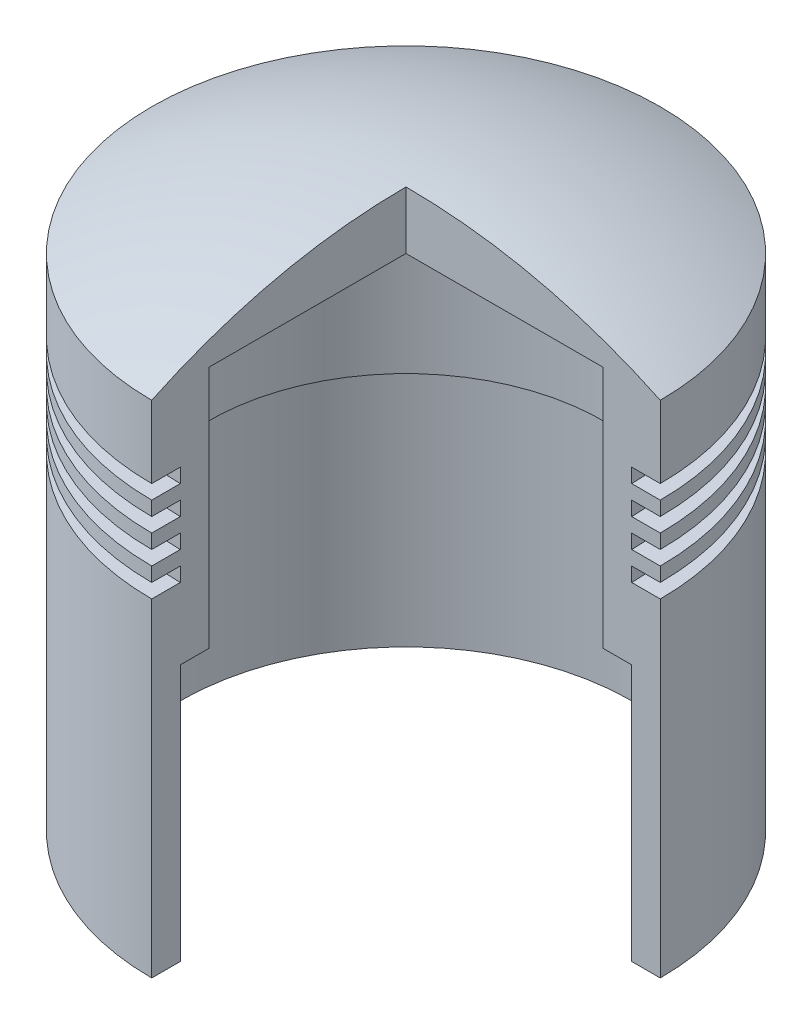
ISO-10303-21;
HEADER;
FILE_DESCRIPTION(('STEP AP214'),'2;1');
FILE_NAME('part.step','',(''),(''),'','','');
FILE_SCHEMA(('AUTOMOTIVE_DESIGN { 1 0 10303 214 1 1 1 1 }'));
ENDSEC;
DATA;
#1=APPLICATION_CONTEXT('core data for automotive mechanical design processes');
#2=APPLICATION_PROTOCOL_DEFINITION('international standard','automotive_design',2000,#1);
#3=PRODUCT_CONTEXT('',#1,'mechanical');
#4=PRODUCT('Part','Part','',(#3));
#5=PRODUCT_RELATED_PRODUCT_CATEGORY('part','',(#4));
#6=PRODUCT_DEFINITION_FORMATION('','',#4);
#7=PRODUCT_DEFINITION_CONTEXT('part definition',#1,'design');
#8=PRODUCT_DEFINITION('design','',#6,#7);
#9=PRODUCT_DEFINITION_SHAPE('','',#8);
#10=(LENGTH_UNIT() NAMED_UNIT(*) SI_UNIT(.MILLI.,.METRE.));
#11=(NAMED_UNIT(*) PLANE_ANGLE_UNIT() SI_UNIT($,.RADIAN.));
#12=(NAMED_UNIT(*) SI_UNIT($,.STERADIAN.) SOLID_ANGLE_UNIT());
#13=UNCERTAINTY_MEASURE_WITH_UNIT(LENGTH_MEASURE(1.E-05),#10,'distance_accuracy_value','');
#14=(GEOMETRIC_REPRESENTATION_CONTEXT(3) GLOBAL_UNCERTAINTY_ASSIGNED_CONTEXT((#13)) GLOBAL_UNIT_ASSIGNED_CONTEXT((#10,
#11,#12)) REPRESENTATION_CONTEXT('',''));
#15=CARTESIAN_POINT('',(0.,0.,0.));
#16=DIRECTION('',(0.,0.,1.));
#17=DIRECTION('',(1.,0.,0.));
#18=AXIS2_PLACEMENT_3D('',#15,#16,#17);
#19=CARTESIAN_POINT('',(4.27667832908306E-13,72.2640545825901,44.5392513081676));
#20=DIRECTION('',(0.,-1.,0.));
#21=DIRECTION('',(1.,0.,0.));
#22=AXIS2_PLACEMENT_3D('',#19,#20,#21);
#23=PLANE('',#22);
#24=CARTESIAN_POINT('',(0.,72.2640545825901,0.));
#25=DIRECTION('',(0.,-1.,0.));
#26=DIRECTION('',(1.,0.,0.));
#27=AXIS2_PLACEMENT_3D('',#24,#25,#26);
#28=CIRCLE('',#27,44.5392513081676);
#29=CARTESIAN_POINT('',(4.27667832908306E-13,72.2640545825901,44.5392513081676));
#30=VERTEX_POINT('',#29);
#31=CARTESIAN_POINT('',(44.5392513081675,72.2640545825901,0.));
#32=VERTEX_POINT('',#31);
#33=EDGE_CURVE('E11',#30,#32,#28,.T.);
#34=ORIENTED_EDGE('',*,*,#33,.T.);
#35=DIRECTION('',(1.,0.,0.));
#36=VECTOR('',#35,1.);
#37=CARTESIAN_POINT('',(44.5392513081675,72.2640545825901,0.));
#38=LINE('',#37,#36);
#39=CARTESIAN_POINT('',(39.5392513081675,72.2640545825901,0.));
#40=VERTEX_POINT('',#39);
#41=EDGE_CURVE('E186',#40,#32,#38,.T.);
#42=ORIENTED_EDGE('',*,*,#41,.F.);
#43=CARTESIAN_POINT('',(0.,72.2640545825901,0.));
#44=DIRECTION('',(0.,-1.,0.));
#45=DIRECTION('',(1.,0.,0.));
#46=AXIS2_PLACEMENT_3D('',#43,#44,#45);
#47=CIRCLE('',#46,39.5392513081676);
#48=CARTESIAN_POINT('',(3.75295612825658E-13,72.2640545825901,39.5392513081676));
#49=VERTEX_POINT('',#48);
#50=EDGE_CURVE('E47',#49,#40,#47,.T.);
#51=ORIENTED_EDGE('',*,*,#50,.F.);
#52=DIRECTION('',(0.,0.,1.));
#53=VECTOR('',#52,1.);
#54=CARTESIAN_POINT('',(4.27667832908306E-13,72.2640545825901,44.5392513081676));
#55=LINE('',#54,#53);
#56=EDGE_CURVE('E188',#49,#30,#55,.T.);
#57=ORIENTED_EDGE('',*,*,#56,.T.);
#58=EDGE_LOOP('',(#34,#42,#51,#57));
#59=FACE_BOUND('',#58,.T.);
#60=ADVANCED_FACE('F32',(#59),#23,.T.);
#61=CARTESIAN_POINT('',(0.,89.9083363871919,0.));
#62=DIRECTION('',(0.,-1.,0.));
#63=DIRECTION('',(1.,0.,0.));
#64=AXIS2_PLACEMENT_3D('',#61,#62,#63);
#65=CYLINDRICAL_SURFACE('',#64,44.5392513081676);
#66=CARTESIAN_POINT('',(0.,74.7640545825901,0.));
#67=DIRECTION('',(0.,-1.,0.));
#68=DIRECTION('',(1.,0.,0.));
#69=AXIS2_PLACEMENT_3D('',#66,#67,#68);
#70=CIRCLE('',#69,44.5392513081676);
#71=CARTESIAN_POINT('',(4.31170152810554E-13,74.7640545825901,44.5392513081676));
#72=VERTEX_POINT('',#71);
#73=CARTESIAN_POINT('',(44.5392513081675,74.7640545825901,0.));
#74=VERTEX_POINT('',#73);
#75=EDGE_CURVE('E40',#72,#74,#70,.T.);
#76=ORIENTED_EDGE('',*,*,#75,.T.);
#77=DIRECTION('',(0.,1.,0.));
#78=VECTOR('',#77,1.);
#79=CARTESIAN_POINT('',(44.5392513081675,72.2640545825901,0.));
#80=LINE('',#79,#78);
#81=EDGE_CURVE('E197',#32,#74,#80,.T.);
#82=ORIENTED_EDGE('',*,*,#81,.F.);
#83=ORIENTED_EDGE('',*,*,#33,.F.);
#84=DIRECTION('',(0.,1.,0.));
#85=VECTOR('',#84,1.);
#86=CARTESIAN_POINT('',(4.27667832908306E-13,72.2640545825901,44.5392513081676));
#87=LINE('',#86,#85);
#88=EDGE_CURVE('E264',#30,#72,#87,.T.);
#89=ORIENTED_EDGE('',*,*,#88,.T.);
#90=EDGE_LOOP('',(#76,#82,#83,#89));
#91=FACE_BOUND('',#90,.T.);
#92=ADVANCED_FACE('F34',(#91),#65,.T.);
#93=CARTESIAN_POINT('',(4.31170152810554E-13,74.7640545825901,44.5392513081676));
#94=DIRECTION('',(0.,1.,0.));
#95=DIRECTION('',(-1.,0.,0.));
#96=AXIS2_PLACEMENT_3D('',#93,#94,#95);
#97=PLANE('',#96);
#98=CARTESIAN_POINT('',(0.,74.7640545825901,0.));
#99=DIRECTION('',(0.,-1.,0.));
#100=DIRECTION('',(1.,0.,0.));
#101=AXIS2_PLACEMENT_3D('',#98,#99,#100);
#102=CIRCLE('',#101,39.5392513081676);
#103=CARTESIAN_POINT('',(3.78797932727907E-13,74.7640545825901,39.5392513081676));
#104=VERTEX_POINT('',#103);
#105=CARTESIAN_POINT('',(39.5392513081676,74.7640545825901,0.));
#106=VERTEX_POINT('',#105);
#107=EDGE_CURVE('E366',#104,#106,#102,.T.);
#108=ORIENTED_EDGE('',*,*,#107,.T.);
#109=DIRECTION('',(-1.,0.,0.));
#110=VECTOR('',#109,1.);
#111=CARTESIAN_POINT('',(44.5392513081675,74.7640545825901,0.));
#112=LINE('',#111,#110);
#113=EDGE_CURVE('E202',#74,#106,#112,.T.);
#114=ORIENTED_EDGE('',*,*,#113,.F.);
#115=ORIENTED_EDGE('',*,*,#75,.F.);
#116=DIRECTION('',(0.,0.,-1.));
#117=VECTOR('',#116,1.);
#118=CARTESIAN_POINT('',(4.31170152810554E-13,74.7640545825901,44.5392513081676));
#119=LINE('',#118,#117);
#120=EDGE_CURVE('E266',#72,#104,#119,.T.);
#121=ORIENTED_EDGE('',*,*,#120,.T.);
#122=EDGE_LOOP('',(#108,#114,#115,#121));
#123=FACE_BOUND('',#122,.T.);
#124=ADVANCED_FACE('F368',(#123),#97,.T.);
#125=CARTESIAN_POINT('',(0.,89.9083363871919,0.));
#126=DIRECTION('',(0.,-1.,0.));
#127=DIRECTION('',(1.,0.,0.));
#128=AXIS2_PLACEMENT_3D('',#125,#126,#127);
#129=CYLINDRICAL_SURFACE('',#128,39.5392513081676);
#130=CARTESIAN_POINT('',(0.,77.2640545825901,0.));
#131=DIRECTION('',(0.,-1.,0.));
#132=DIRECTION('',(1.,0.,0.));
#133=AXIS2_PLACEMENT_3D('',#130,#131,#132);
#134=CIRCLE('',#133,39.5392513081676);
#135=CARTESIAN_POINT('',(3.82300252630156E-13,77.2640545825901,39.5392513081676));
#136=VERTEX_POINT('',#135);
#137=CARTESIAN_POINT('',(39.5392513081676,77.2640545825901,0.));
#138=VERTEX_POINT('',#137);
#139=EDGE_CURVE('E364',#136,#138,#134,.T.);
#140=ORIENTED_EDGE('',*,*,#139,.T.);
#141=DIRECTION('',(0.,1.,0.));
#142=VECTOR('',#141,1.);
#143=CARTESIAN_POINT('',(39.5392513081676,74.7640545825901,0.));
#144=LINE('',#143,#142);
#145=EDGE_CURVE('E204',#106,#138,#144,.T.);
#146=ORIENTED_EDGE('',*,*,#145,.F.);
#147=ORIENTED_EDGE('',*,*,#107,.F.);
#148=DIRECTION('',(0.,1.,0.));
#149=VECTOR('',#148,1.);
#150=CARTESIAN_POINT('',(3.78797932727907E-13,74.7640545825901,39.5392513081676));
#151=LINE('',#150,#149);
#152=EDGE_CURVE('E269',#104,#136,#151,.T.);
#153=ORIENTED_EDGE('',*,*,#152,.T.);
#154=EDGE_LOOP('',(#140,#146,#147,#153));
#155=FACE_BOUND('',#154,.T.);
#156=ADVANCED_FACE('F374',(#155),#129,.T.);
#157=CARTESIAN_POINT('',(3.82300252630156E-13,77.2640545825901,39.5392513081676));
#158=DIRECTION('',(0.,-1.,0.));
#159=DIRECTION('',(1.,0.,0.));
#160=AXIS2_PLACEMENT_3D('',#157,#158,#159);
#161=PLANE('',#160);
#162=CARTESIAN_POINT('',(0.,77.2640545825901,0.));
#163=DIRECTION('',(0.,-1.,0.));
#164=DIRECTION('',(1.,0.,0.));
#165=AXIS2_PLACEMENT_3D('',#162,#163,#164);
#166=CIRCLE('',#165,44.5392513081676);
#167=CARTESIAN_POINT('',(4.34672472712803E-13,77.2640545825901,44.5392513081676));
#168=VERTEX_POINT('',#167);
#169=CARTESIAN_POINT('',(44.5392513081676,77.2640545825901,0.));
#170=VERTEX_POINT('',#169);
#171=EDGE_CURVE('E362',#168,#170,#166,.T.);
#172=ORIENTED_EDGE('',*,*,#171,.T.);
#173=DIRECTION('',(1.,0.,0.));
#174=VECTOR('',#173,1.);
#175=CARTESIAN_POINT('',(39.5392513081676,77.2640545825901,0.));
#176=LINE('',#175,#174);
#177=EDGE_CURVE('E209',#138,#170,#176,.T.);
#178=ORIENTED_EDGE('',*,*,#177,.F.);
#179=ORIENTED_EDGE('',*,*,#139,.F.);
#180=DIRECTION('',(0.,0.,1.));
#181=VECTOR('',#180,1.);
#182=CARTESIAN_POINT('',(3.82300252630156E-13,77.2640545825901,39.5392513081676));
#183=LINE('',#182,#181);
#184=EDGE_CURVE('E272',#136,#168,#183,.T.);
#185=ORIENTED_EDGE('',*,*,#184,.T.);
#186=EDGE_LOOP('',(#172,#178,#179,#185));
#187=FACE_BOUND('',#186,.T.);
#188=ADVANCED_FACE('F377',(#187),#161,.T.);
#189=CARTESIAN_POINT('',(0.,89.9083363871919,0.));
#190=DIRECTION('',(0.,-1.,0.));
#191=DIRECTION('',(1.,0.,0.));
#192=AXIS2_PLACEMENT_3D('',#189,#190,#191);
#193=CYLINDRICAL_SURFACE('',#192,44.5392513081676);
#194=CARTESIAN_POINT('',(0.,89.9083363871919,0.));
#195=DIRECTION('',(0.,-1.,0.));
#196=DIRECTION('',(1.,0.,0.));
#197=AXIS2_PLACEMENT_3D('',#194,#195,#196);
#198=CIRCLE('',#197,44.5392513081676);
#199=CARTESIAN_POINT('',(4.52386200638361E-13,89.9083363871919,44.5392513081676));
#200=VERTEX_POINT('',#199);
#201=CARTESIAN_POINT('',(44.5392513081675,89.9083363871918,0.));
#202=VERTEX_POINT('',#201);
#203=EDGE_CURVE('E360',#200,#202,#198,.T.);
#204=ORIENTED_EDGE('',*,*,#203,.T.);
#205=DIRECTION('',(0.,1.,0.));
#206=VECTOR('',#205,1.);
#207=CARTESIAN_POINT('',(44.5392513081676,77.2640545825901,0.));
#208=LINE('',#207,#206);
#209=EDGE_CURVE('E212',#170,#202,#208,.T.);
#210=ORIENTED_EDGE('',*,*,#209,.F.);
#211=ORIENTED_EDGE('',*,*,#171,.F.);
#212=DIRECTION('',(0.,1.,0.));
#213=VECTOR('',#212,1.);
#214=CARTESIAN_POINT('',(4.34672472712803E-13,77.2640545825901,44.5392513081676));
#215=LINE('',#214,#213);
#216=EDGE_CURVE('E275',#168,#200,#215,.T.);
#217=ORIENTED_EDGE('',*,*,#216,.T.);
#218=EDGE_LOOP('',(#204,#210,#211,#217));
#219=FACE_BOUND('',#218,.T.);
#220=ADVANCED_FACE('F382',(#219),#193,.T.);
#221=CARTESIAN_POINT('',(-1.44760897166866E-13,-3.33214926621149,1.59506046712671E-13));
#222=DIRECTION('',(0.,-1.,0.));
#223=DIRECTION('',(0.,0.,1.));
#224=AXIS2_PLACEMENT_3D('',#221,#222,#223);
#225=SPHERICAL_SURFACE('',#224,103.332149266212);
#226=CARTESIAN_POINT('',(0.,-3.33214926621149,0.));
#227=DIRECTION('',(0.,0.,1.));
#228=DIRECTION('',(1.,0.,0.));
#229=AXIS2_PLACEMENT_3D('',#226,#227,#228);
#230=CIRCLE('',#229,103.332149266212);
#231=CARTESIAN_POINT('',(0.,100.,0.));
#232=VERTEX_POINT('',#231);
#233=EDGE_CURVE('E215',#202,#232,#230,.T.);
#234=ORIENTED_EDGE('',*,*,#233,.F.);
#235=ORIENTED_EDGE('',*,*,#203,.F.);
#236=CARTESIAN_POINT('',(-1.44760897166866E-13,-3.33214926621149,1.59506046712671E-13));
#237=DIRECTION('',(-1.,0.,0.));
#238=DIRECTION('',(0.,0.,1.));
#239=AXIS2_PLACEMENT_3D('',#236,#237,#238);
#240=CIRCLE('',#239,103.332149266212);
#241=EDGE_CURVE('E278',#200,#232,#240,.T.);
#242=ORIENTED_EDGE('',*,*,#241,.T.);
#243=EDGE_LOOP('',(#234,#235,#242));
#244=FACE_BOUND('',#243,.T.);
#245=ADVANCED_FACE('F385',(#244),#225,.T.);
#246=CARTESIAN_POINT('',(3.47641760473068E-13,89.9083363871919,34.5392513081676));
#247=DIRECTION('',(0.,-1.,0.));
#248=DIRECTION('',(1.,0.,0.));
#249=AXIS2_PLACEMENT_3D('',#246,#247,#248);
#250=PLANE('',#249);
#251=CARTESIAN_POINT('',(0.,89.9083363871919,0.));
#252=DIRECTION('',(0.,-1.,0.));
#253=DIRECTION('',(1.,0.,0.));
#254=AXIS2_PLACEMENT_3D('',#251,#252,#253);
#255=CIRCLE('',#254,34.5392513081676);
#256=CARTESIAN_POINT('',(3.47641760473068E-13,89.9083363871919,34.5392513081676));
#257=VERTEX_POINT('',#256);
#258=CARTESIAN_POINT('',(34.5392513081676,89.9083363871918,0.));
#259=VERTEX_POINT('',#258);
#260=EDGE_CURVE('E358',#257,#259,#255,.T.);
#261=ORIENTED_EDGE('',*,*,#260,.T.);
#262=DIRECTION('',(1.,0.,0.));
#263=VECTOR('',#262,1.);
#264=CARTESIAN_POINT('',(34.5392513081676,89.9083363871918,0.));
#265=LINE('',#264,#263);
#266=CARTESIAN_POINT('',(0.,89.9083363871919,0.));
#267=VERTEX_POINT('',#266);
#268=EDGE_CURVE('E218',#267,#259,#265,.T.);
#269=ORIENTED_EDGE('',*,*,#268,.F.);
#270=DIRECTION('',(0.,0.,1.));
#271=VECTOR('',#270,1.);
#272=CARTESIAN_POINT('',(3.47641760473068E-13,89.9083363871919,34.5392513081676));
#273=LINE('',#272,#271);
#274=EDGE_CURVE('E284',#267,#257,#273,.T.);
#275=ORIENTED_EDGE('',*,*,#274,.T.);
#276=EDGE_LOOP('',(#261,#269,#275));
#277=FACE_BOUND('',#276,.T.);
#278=ADVANCED_FACE('F393',(#277),#250,.T.);
#279=CARTESIAN_POINT('',(0.,89.9083363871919,0.));
#280=DIRECTION('',(0.,-1.,0.));
#281=DIRECTION('',(1.,0.,0.));
#282=AXIS2_PLACEMENT_3D('',#279,#280,#281);
#283=CYLINDRICAL_SURFACE('',#282,34.5392513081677);
#284=CARTESIAN_POINT('',(0.,47.26405458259,0.));
#285=DIRECTION('',(0.,-1.,0.));
#286=DIRECTION('',(1.,0.,0.));
#287=AXIS2_PLACEMENT_3D('',#284,#285,#286);
#288=CIRCLE('',#287,34.5392513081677);
#289=CARTESIAN_POINT('',(2.87900193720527E-13,47.26405458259,34.5392513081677));
#290=VERTEX_POINT('',#289);
#291=CARTESIAN_POINT('',(34.5392513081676,47.26405458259,0.));
#292=VERTEX_POINT('',#291);
#293=EDGE_CURVE('E356',#290,#292,#288,.T.);
#294=ORIENTED_EDGE('',*,*,#293,.T.);
#295=DIRECTION('',(0.,-1.,0.));
#296=VECTOR('',#295,1.);
#297=CARTESIAN_POINT('',(34.5392513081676,47.26405458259,0.));
#298=LINE('',#297,#296);
#299=EDGE_CURVE('E221',#259,#292,#298,.T.);
#300=ORIENTED_EDGE('',*,*,#299,.F.);
#301=ORIENTED_EDGE('',*,*,#260,.F.);
#302=DIRECTION('',(0.,-1.,0.));
#303=VECTOR('',#302,1.);
#304=CARTESIAN_POINT('',(2.87900193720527E-13,47.26405458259,34.5392513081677));
#305=LINE('',#304,#303);
#306=EDGE_CURVE('E287',#257,#290,#305,.T.);
#307=ORIENTED_EDGE('',*,*,#306,.T.);
#308=EDGE_LOOP('',(#294,#300,#301,#307));
#309=FACE_BOUND('',#308,.T.);
#310=ADVANCED_FACE('F395',(#309),#283,.F.);
#311=CARTESIAN_POINT('',(3.40272413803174E-13,47.2640545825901,39.5392513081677));
#312=DIRECTION('',(0.,-1.,0.));
#313=DIRECTION('',(1.,0.,0.));
#314=AXIS2_PLACEMENT_3D('',#311,#312,#313);
#315=PLANE('',#314);
#316=CARTESIAN_POINT('',(0.,47.2640545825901,0.));
#317=DIRECTION('',(0.,-1.,0.));
#318=DIRECTION('',(1.,0.,0.));
#319=AXIS2_PLACEMENT_3D('',#316,#317,#318);
#320=CIRCLE('',#319,39.5392513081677);
#321=CARTESIAN_POINT('',(3.40272413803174E-13,47.2640545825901,39.5392513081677));
#322=VERTEX_POINT('',#321);
#323=CARTESIAN_POINT('',(39.5392513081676,47.26405458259,0.));
#324=VERTEX_POINT('',#323);
#325=EDGE_CURVE('E354',#322,#324,#320,.T.);
#326=ORIENTED_EDGE('',*,*,#325,.T.);
#327=DIRECTION('',(1.,0.,0.));
#328=VECTOR('',#327,1.);
#329=CARTESIAN_POINT('',(39.5392513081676,47.26405458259,0.));
#330=LINE('',#329,#328);
#331=EDGE_CURVE('E224',#292,#324,#330,.T.);
#332=ORIENTED_EDGE('',*,*,#331,.F.);
#333=ORIENTED_EDGE('',*,*,#293,.F.);
#334=DIRECTION('',(0.,0.,1.));
#335=VECTOR('',#334,1.);
#336=CARTESIAN_POINT('',(3.40272413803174E-13,47.2640545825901,39.5392513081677));
#337=LINE('',#336,#335);
#338=EDGE_CURVE('E290',#290,#322,#337,.T.);
#339=ORIENTED_EDGE('',*,*,#338,.T.);
#340=EDGE_LOOP('',(#326,#332,#333,#339));
#341=FACE_BOUND('',#340,.T.);
#342=ADVANCED_FACE('F399',(#341),#315,.T.);
#343=CARTESIAN_POINT('',(0.,89.9083363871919,0.));
#344=DIRECTION('',(0.,-1.,0.));
#345=DIRECTION('',(1.,0.,0.));
#346=AXIS2_PLACEMENT_3D('',#343,#344,#345);
#347=CYLINDRICAL_SURFACE('',#346,39.5392513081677);
#348=CARTESIAN_POINT('',(-1.36921018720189E-13,2.26405458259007,0.));
#349=DIRECTION('',(0.,-1.,0.));
#350=DIRECTION('',(1.,0.,0.));
#351=AXIS2_PLACEMENT_3D('',#348,#349,#350);
#352=CIRCLE('',#351,39.5392513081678);
#353=CARTESIAN_POINT('',(2.77230655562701E-13,2.26405458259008,39.5392513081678));
#354=VERTEX_POINT('',#353);
#355=CARTESIAN_POINT('',(39.5392513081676,2.26405458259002,0.));
#356=VERTEX_POINT('',#355);
#357=EDGE_CURVE('E352',#354,#356,#352,.T.);
#358=ORIENTED_EDGE('',*,*,#357,.T.);
#359=DIRECTION('',(0.,-1.,0.));
#360=VECTOR('',#359,1.);
#361=CARTESIAN_POINT('',(39.5392513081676,2.26405458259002,0.));
#362=LINE('',#361,#360);
#363=EDGE_CURVE('E227',#324,#356,#362,.T.);
#364=ORIENTED_EDGE('',*,*,#363,.F.);
#365=ORIENTED_EDGE('',*,*,#325,.F.);
#366=DIRECTION('',(0.,-1.,0.));
#367=VECTOR('',#366,1.);
#368=CARTESIAN_POINT('',(2.77230655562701E-13,2.26405458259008,39.5392513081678));
#369=LINE('',#368,#367);
#370=EDGE_CURVE('E293',#322,#354,#369,.T.);
#371=ORIENTED_EDGE('',*,*,#370,.T.);
#372=EDGE_LOOP('',(#358,#364,#365,#371));
#373=FACE_BOUND('',#372,.T.);
#374=ADVANCED_FACE('F402',(#373),#347,.F.);
#375=CARTESIAN_POINT('',(3.29602875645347E-13,2.26405458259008,44.5392513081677));
#376=DIRECTION('',(0.,-1.,0.));
#377=DIRECTION('',(1.,0.,0.));
#378=AXIS2_PLACEMENT_3D('',#375,#376,#377);
#379=PLANE('',#378);
#380=CARTESIAN_POINT('',(-1.36921018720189E-13,2.26405458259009,0.));
#381=DIRECTION('',(0.,-1.,0.));
#382=DIRECTION('',(1.,0.,0.));
#383=AXIS2_PLACEMENT_3D('',#380,#381,#382);
#384=CIRCLE('',#383,44.5392513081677);
#385=CARTESIAN_POINT('',(3.29602875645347E-13,2.26405458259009,44.5392513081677));
#386=VERTEX_POINT('',#385);
#387=CARTESIAN_POINT('',(44.5392513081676,2.26405458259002,0.));
#388=VERTEX_POINT('',#387);
#389=EDGE_CURVE('E350',#386,#388,#384,.T.);
#390=ORIENTED_EDGE('',*,*,#389,.T.);
#391=DIRECTION('',(1.,0.,0.));
#392=VECTOR('',#391,1.);
#393=CARTESIAN_POINT('',(44.5392513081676,2.26405458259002,0.));
#394=LINE('',#393,#392);
#395=EDGE_CURVE('E230',#356,#388,#394,.T.);
#396=ORIENTED_EDGE('',*,*,#395,.F.);
#397=ORIENTED_EDGE('',*,*,#357,.F.);
#398=DIRECTION('',(0.,0.,1.));
#399=VECTOR('',#398,1.);
#400=CARTESIAN_POINT('',(3.29602875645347E-13,2.26405458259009,44.5392513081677));
#401=LINE('',#400,#399);
#402=EDGE_CURVE('E296',#354,#386,#401,.T.);
#403=ORIENTED_EDGE('',*,*,#402,.T.);
#404=EDGE_LOOP('',(#390,#396,#397,#403));
#405=FACE_BOUND('',#404,.T.);
#406=ADVANCED_FACE('F407',(#405),#379,.T.);
#407=CARTESIAN_POINT('',(0.,89.9083363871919,0.));
#408=DIRECTION('',(0.,-1.,0.));
#409=DIRECTION('',(1.,0.,0.));
#410=AXIS2_PLACEMENT_3D('',#407,#408,#409);
#411=CYLINDRICAL_SURFACE('',#410,44.5392513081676);
#412=CARTESIAN_POINT('',(0.,59.7640545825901,0.));
#413=DIRECTION('',(0.,-1.,0.));
#414=DIRECTION('',(1.,0.,0.));
#415=AXIS2_PLACEMENT_3D('',#412,#413,#414);
#416=CIRCLE('',#415,44.5392513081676);
#417=CARTESIAN_POINT('',(4.10156233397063E-13,59.7640545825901,44.5392513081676));
#418=VERTEX_POINT('',#417);
#419=CARTESIAN_POINT('',(44.5392513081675,59.7640545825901,0.));
#420=VERTEX_POINT('',#419);
#421=EDGE_CURVE('E348',#418,#420,#416,.T.);
#422=ORIENTED_EDGE('',*,*,#421,.T.);
#423=DIRECTION('',(0.,1.,0.));
#424=VECTOR('',#423,1.);
#425=CARTESIAN_POINT('',(44.5392513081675,59.7640545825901,0.));
#426=LINE('',#425,#424);
#427=EDGE_CURVE('E233',#388,#420,#426,.T.);
#428=ORIENTED_EDGE('',*,*,#427,.F.);
#429=ORIENTED_EDGE('',*,*,#389,.F.);
#430=DIRECTION('',(0.,1.,0.));
#431=VECTOR('',#430,1.);
#432=CARTESIAN_POINT('',(4.10156233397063E-13,59.7640545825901,44.5392513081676));
#433=LINE('',#432,#431);
#434=EDGE_CURVE('E299',#386,#418,#433,.T.);
#435=ORIENTED_EDGE('',*,*,#434,.T.);
#436=EDGE_LOOP('',(#422,#428,#429,#435));
#437=FACE_BOUND('',#436,.T.);
#438=ADVANCED_FACE('F410',(#437),#411,.T.);
#439=CARTESIAN_POINT('',(3.57784013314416E-13,59.7640545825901,39.5392513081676));
#440=DIRECTION('',(0.,1.,0.));
#441=DIRECTION('',(-1.,0.,0.));
#442=AXIS2_PLACEMENT_3D('',#439,#440,#441);
#443=PLANE('',#442);
#444=CARTESIAN_POINT('',(0.,59.7640545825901,0.));
#445=DIRECTION('',(0.,-1.,0.));
#446=DIRECTION('',(1.,0.,0.));
#447=AXIS2_PLACEMENT_3D('',#444,#445,#446);
#448=CIRCLE('',#447,39.5392513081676);
#449=CARTESIAN_POINT('',(3.57784013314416E-13,59.7640545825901,39.5392513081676));
#450=VERTEX_POINT('',#449);
#451=CARTESIAN_POINT('',(39.5392513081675,59.7640545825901,0.));
#452=VERTEX_POINT('',#451);
#453=EDGE_CURVE('E346',#450,#452,#448,.T.);
#454=ORIENTED_EDGE('',*,*,#453,.T.);
#455=DIRECTION('',(-1.,0.,0.));
#456=VECTOR('',#455,1.);
#457=CARTESIAN_POINT('',(39.5392513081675,59.7640545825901,0.));
#458=LINE('',#457,#456);
#459=EDGE_CURVE('E236',#420,#452,#458,.T.);
#460=ORIENTED_EDGE('',*,*,#459,.F.);
#461=ORIENTED_EDGE('',*,*,#421,.F.);
#462=DIRECTION('',(0.,0.,-1.));
#463=VECTOR('',#462,1.);
#464=CARTESIAN_POINT('',(3.57784013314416E-13,59.7640545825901,39.5392513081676));
#465=LINE('',#464,#463);
#466=EDGE_CURVE('E302',#418,#450,#465,.T.);
#467=ORIENTED_EDGE('',*,*,#466,.T.);
#468=EDGE_LOOP('',(#454,#460,#461,#467));
#469=FACE_BOUND('',#468,.T.);
#470=ADVANCED_FACE('F415',(#469),#443,.T.);
#471=CARTESIAN_POINT('',(0.,89.9083363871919,0.));
#472=DIRECTION('',(0.,-1.,0.));
#473=DIRECTION('',(1.,0.,0.));
#474=AXIS2_PLACEMENT_3D('',#471,#472,#473);
#475=CYLINDRICAL_SURFACE('',#474,39.5392513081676);
#476=CARTESIAN_POINT('',(0.,62.2640545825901,0.));
#477=DIRECTION('',(0.,-1.,0.));
#478=DIRECTION('',(1.,0.,0.));
#479=AXIS2_PLACEMENT_3D('',#476,#477,#478);
#480=CIRCLE('',#479,39.5392513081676);
#481=CARTESIAN_POINT('',(3.61286333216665E-13,62.2640545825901,39.5392513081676));
#482=VERTEX_POINT('',#481);
#483=CARTESIAN_POINT('',(39.5392513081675,62.2640545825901,0.));
#484=VERTEX_POINT('',#483);
#485=EDGE_CURVE('E344',#482,#484,#480,.T.);
#486=ORIENTED_EDGE('',*,*,#485,.T.);
#487=DIRECTION('',(0.,1.,0.));
#488=VECTOR('',#487,1.);
#489=CARTESIAN_POINT('',(39.5392513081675,62.2640545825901,0.));
#490=LINE('',#489,#488);
#491=EDGE_CURVE('E239',#452,#484,#490,.T.);
#492=ORIENTED_EDGE('',*,*,#491,.F.);
#493=ORIENTED_EDGE('',*,*,#453,.F.);
#494=DIRECTION('',(0.,1.,0.));
#495=VECTOR('',#494,1.);
#496=CARTESIAN_POINT('',(3.61286333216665E-13,62.2640545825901,39.5392513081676));
#497=LINE('',#496,#495);
#498=EDGE_CURVE('E305',#450,#482,#497,.T.);
#499=ORIENTED_EDGE('',*,*,#498,.T.);
#500=EDGE_LOOP('',(#486,#492,#493,#499));
#501=FACE_BOUND('',#500,.T.);
#502=ADVANCED_FACE('F418',(#501),#475,.T.);
#503=CARTESIAN_POINT('',(4.13658553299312E-13,62.2640545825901,44.5392513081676));
#504=DIRECTION('',(0.,-1.,0.));
#505=DIRECTION('',(1.,0.,0.));
#506=AXIS2_PLACEMENT_3D('',#503,#504,#505);
#507=PLANE('',#506);
#508=CARTESIAN_POINT('',(0.,62.2640545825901,0.));
#509=DIRECTION('',(0.,-1.,0.));
#510=DIRECTION('',(1.,0.,0.));
#511=AXIS2_PLACEMENT_3D('',#508,#509,#510);
#512=CIRCLE('',#511,44.5392513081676);
#513=CARTESIAN_POINT('',(4.13658553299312E-13,62.2640545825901,44.5392513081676));
#514=VERTEX_POINT('',#513);
#515=CARTESIAN_POINT('',(44.5392513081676,62.2640545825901,0.));
#516=VERTEX_POINT('',#515);
#517=EDGE_CURVE('E342',#514,#516,#512,.T.);
#518=ORIENTED_EDGE('',*,*,#517,.T.);
#519=DIRECTION('',(1.,0.,0.));
#520=VECTOR('',#519,1.);
#521=CARTESIAN_POINT('',(44.5392513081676,62.2640545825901,0.));
#522=LINE('',#521,#520);
#523=EDGE_CURVE('E242',#484,#516,#522,.T.);
#524=ORIENTED_EDGE('',*,*,#523,.F.);
#525=ORIENTED_EDGE('',*,*,#485,.F.);
#526=DIRECTION('',(0.,0.,1.));
#527=VECTOR('',#526,1.);
#528=CARTESIAN_POINT('',(4.13658553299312E-13,62.2640545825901,44.5392513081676));
#529=LINE('',#528,#527);
#530=EDGE_CURVE('E308',#482,#514,#529,.T.);
#531=ORIENTED_EDGE('',*,*,#530,.T.);
#532=EDGE_LOOP('',(#518,#524,#525,#531));
#533=FACE_BOUND('',#532,.T.);
#534=ADVANCED_FACE('F423',(#533),#507,.T.);
#535=CARTESIAN_POINT('',(0.,89.9083363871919,0.));
#536=DIRECTION('',(0.,-1.,0.));
#537=DIRECTION('',(1.,0.,0.));
#538=AXIS2_PLACEMENT_3D('',#535,#536,#537);
#539=CYLINDRICAL_SURFACE('',#538,44.5392513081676);
#540=CARTESIAN_POINT('',(0.,64.7640545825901,0.));
#541=DIRECTION('',(0.,-1.,0.));
#542=DIRECTION('',(1.,0.,0.));
#543=AXIS2_PLACEMENT_3D('',#540,#541,#542);
#544=CIRCLE('',#543,44.5392513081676);
#545=CARTESIAN_POINT('',(4.1716087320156E-13,64.7640545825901,44.5392513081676));
#546=VERTEX_POINT('',#545);
#547=CARTESIAN_POINT('',(44.5392513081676,64.7640545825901,0.));
#548=VERTEX_POINT('',#547);
#549=EDGE_CURVE('E340',#546,#548,#544,.T.);
#550=ORIENTED_EDGE('',*,*,#549,.T.);
#551=DIRECTION('',(0.,1.,0.));
#552=VECTOR('',#551,1.);
#553=CARTESIAN_POINT('',(44.5392513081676,64.7640545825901,0.));
#554=LINE('',#553,#552);
#555=EDGE_CURVE('E245',#516,#548,#554,.T.);
#556=ORIENTED_EDGE('',*,*,#555,.F.);
#557=ORIENTED_EDGE('',*,*,#517,.F.);
#558=DIRECTION('',(0.,1.,0.));
#559=VECTOR('',#558,1.);
#560=CARTESIAN_POINT('',(4.1716087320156E-13,64.7640545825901,44.5392513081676));
#561=LINE('',#560,#559);
#562=EDGE_CURVE('E311',#514,#546,#561,.T.);
#563=ORIENTED_EDGE('',*,*,#562,.T.);
#564=EDGE_LOOP('',(#550,#556,#557,#563));
#565=FACE_BOUND('',#564,.T.);
#566=ADVANCED_FACE('F426',(#565),#539,.T.);
#567=CARTESIAN_POINT('',(3.64788653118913E-13,64.7640545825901,39.5392513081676));
#568=DIRECTION('',(0.,1.,0.));
#569=DIRECTION('',(-1.,0.,0.));
#570=AXIS2_PLACEMENT_3D('',#567,#568,#569);
#571=PLANE('',#570);
#572=CARTESIAN_POINT('',(0.,64.7640545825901,0.));
#573=DIRECTION('',(0.,-1.,0.));
#574=DIRECTION('',(1.,0.,0.));
#575=AXIS2_PLACEMENT_3D('',#572,#573,#574);
#576=CIRCLE('',#575,39.5392513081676);
#577=CARTESIAN_POINT('',(3.64788653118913E-13,64.7640545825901,39.5392513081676));
#578=VERTEX_POINT('',#577);
#579=CARTESIAN_POINT('',(39.5392513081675,64.7640545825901,0.));
#580=VERTEX_POINT('',#579);
#581=EDGE_CURVE('E338',#578,#580,#576,.T.);
#582=ORIENTED_EDGE('',*,*,#581,.T.);
#583=DIRECTION('',(-1.,0.,0.));
#584=VECTOR('',#583,1.);
#585=CARTESIAN_POINT('',(39.5392513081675,64.7640545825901,0.));
#586=LINE('',#585,#584);
#587=EDGE_CURVE('E248',#548,#580,#586,.T.);
#588=ORIENTED_EDGE('',*,*,#587,.F.);
#589=ORIENTED_EDGE('',*,*,#549,.F.);
#590=DIRECTION('',(0.,0.,-1.));
#591=VECTOR('',#590,1.);
#592=CARTESIAN_POINT('',(3.64788653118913E-13,64.7640545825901,39.5392513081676));
#593=LINE('',#592,#591);
#594=EDGE_CURVE('E314',#546,#578,#593,.T.);
#595=ORIENTED_EDGE('',*,*,#594,.T.);
#596=EDGE_LOOP('',(#582,#588,#589,#595));
#597=FACE_BOUND('',#596,.T.);
#598=ADVANCED_FACE('F431',(#597),#571,.T.);
#599=CARTESIAN_POINT('',(0.,89.9083363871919,0.));
#600=DIRECTION('',(0.,-1.,0.));
#601=DIRECTION('',(1.,0.,0.));
#602=AXIS2_PLACEMENT_3D('',#599,#600,#601);
#603=CYLINDRICAL_SURFACE('',#602,39.5392513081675);
#604=CARTESIAN_POINT('',(0.,67.2640545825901,0.));
#605=DIRECTION('',(0.,-1.,0.));
#606=DIRECTION('',(1.,0.,0.));
#607=AXIS2_PLACEMENT_3D('',#604,#605,#606);
#608=CIRCLE('',#607,39.5392513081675);
#609=CARTESIAN_POINT('',(3.68290973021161E-13,67.2640545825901,39.5392513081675));
#610=VERTEX_POINT('',#609);
#611=CARTESIAN_POINT('',(39.5392513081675,67.2640545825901,0.));
#612=VERTEX_POINT('',#611);
#613=EDGE_CURVE('E336',#610,#612,#608,.T.);
#614=ORIENTED_EDGE('',*,*,#613,.T.);
#615=DIRECTION('',(0.,1.,0.));
#616=VECTOR('',#615,1.);
#617=CARTESIAN_POINT('',(39.5392513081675,67.2640545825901,0.));
#618=LINE('',#617,#616);
#619=EDGE_CURVE('E251',#580,#612,#618,.T.);
#620=ORIENTED_EDGE('',*,*,#619,.F.);
#621=ORIENTED_EDGE('',*,*,#581,.F.);
#622=DIRECTION('',(0.,1.,0.));
#623=VECTOR('',#622,1.);
#624=CARTESIAN_POINT('',(3.68290973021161E-13,67.2640545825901,39.5392513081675));
#625=LINE('',#624,#623);
#626=EDGE_CURVE('E317',#578,#610,#625,.T.);
#627=ORIENTED_EDGE('',*,*,#626,.T.);
#628=EDGE_LOOP('',(#614,#620,#621,#627));
#629=FACE_BOUND('',#628,.T.);
#630=ADVANCED_FACE('F434',(#629),#603,.T.);
#631=CARTESIAN_POINT('',(4.20663193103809E-13,67.2640545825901,44.5392513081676));
#632=DIRECTION('',(0.,-1.,0.));
#633=DIRECTION('',(1.,0.,0.));
#634=AXIS2_PLACEMENT_3D('',#631,#632,#633);
#635=PLANE('',#634);
#636=CARTESIAN_POINT('',(0.,67.2640545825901,0.));
#637=DIRECTION('',(0.,-1.,0.));
#638=DIRECTION('',(1.,0.,0.));
#639=AXIS2_PLACEMENT_3D('',#636,#637,#638);
#640=CIRCLE('',#639,44.5392513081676);
#641=CARTESIAN_POINT('',(4.20663193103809E-13,67.2640545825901,44.5392513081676));
#642=VERTEX_POINT('',#641);
#643=CARTESIAN_POINT('',(44.5392513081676,67.2640545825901,0.));
#644=VERTEX_POINT('',#643);
#645=EDGE_CURVE('E334',#642,#644,#640,.T.);
#646=ORIENTED_EDGE('',*,*,#645,.T.);
#647=DIRECTION('',(1.,0.,0.));
#648=VECTOR('',#647,1.);
#649=CARTESIAN_POINT('',(44.5392513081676,67.2640545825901,0.));
#650=LINE('',#649,#648);
#651=EDGE_CURVE('E254',#612,#644,#650,.T.);
#652=ORIENTED_EDGE('',*,*,#651,.F.);
#653=ORIENTED_EDGE('',*,*,#613,.F.);
#654=DIRECTION('',(0.,0.,1.));
#655=VECTOR('',#654,1.);
#656=CARTESIAN_POINT('',(4.20663193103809E-13,67.2640545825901,44.5392513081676));
#657=LINE('',#656,#655);
#658=EDGE_CURVE('E320',#610,#642,#657,.T.);
#659=ORIENTED_EDGE('',*,*,#658,.T.);
#660=EDGE_LOOP('',(#646,#652,#653,#659));
#661=FACE_BOUND('',#660,.T.);
#662=ADVANCED_FACE('F439',(#661),#635,.T.);
#663=CARTESIAN_POINT('',(0.,89.9083363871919,0.));
#664=DIRECTION('',(0.,-1.,0.));
#665=DIRECTION('',(1.,0.,0.));
#666=AXIS2_PLACEMENT_3D('',#663,#664,#665);
#667=CYLINDRICAL_SURFACE('',#666,44.5392513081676);
#668=CARTESIAN_POINT('',(0.,69.7640545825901,0.));
#669=DIRECTION('',(0.,-1.,0.));
#670=DIRECTION('',(1.,0.,0.));
#671=AXIS2_PLACEMENT_3D('',#668,#669,#670);
#672=CIRCLE('',#671,44.5392513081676);
#673=CARTESIAN_POINT('',(4.24165513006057E-13,69.7640545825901,44.5392513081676));
#674=VERTEX_POINT('',#673);
#675=CARTESIAN_POINT('',(44.5392513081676,69.7640545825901,0.));
#676=VERTEX_POINT('',#675);
#677=EDGE_CURVE('E332',#674,#676,#672,.T.);
#678=ORIENTED_EDGE('',*,*,#677,.T.);
#679=DIRECTION('',(0.,1.,0.));
#680=VECTOR('',#679,1.);
#681=CARTESIAN_POINT('',(44.5392513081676,69.7640545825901,0.));
#682=LINE('',#681,#680);
#683=EDGE_CURVE('E257',#644,#676,#682,.T.);
#684=ORIENTED_EDGE('',*,*,#683,.F.);
#685=ORIENTED_EDGE('',*,*,#645,.F.);
#686=DIRECTION('',(0.,1.,0.));
#687=VECTOR('',#686,1.);
#688=CARTESIAN_POINT('',(4.24165513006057E-13,69.7640545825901,44.5392513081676));
#689=LINE('',#688,#687);
#690=EDGE_CURVE('E323',#642,#674,#689,.T.);
#691=ORIENTED_EDGE('',*,*,#690,.T.);
#692=EDGE_LOOP('',(#678,#684,#685,#691));
#693=FACE_BOUND('',#692,.T.);
#694=ADVANCED_FACE('F442',(#693),#667,.T.);
#695=CARTESIAN_POINT('',(3.7179329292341E-13,69.7640545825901,39.5392513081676));
#696=DIRECTION('',(0.,1.,0.));
#697=DIRECTION('',(-1.,0.,0.));
#698=AXIS2_PLACEMENT_3D('',#695,#696,#697);
#699=PLANE('',#698);
#700=CARTESIAN_POINT('',(0.,69.7640545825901,0.));
#701=DIRECTION('',(0.,-1.,0.));
#702=DIRECTION('',(1.,0.,0.));
#703=AXIS2_PLACEMENT_3D('',#700,#701,#702);
#704=CIRCLE('',#703,39.5392513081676);
#705=CARTESIAN_POINT('',(3.7179329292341E-13,69.7640545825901,39.5392513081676));
#706=VERTEX_POINT('',#705);
#707=CARTESIAN_POINT('',(39.5392513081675,69.7640545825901,0.));
#708=VERTEX_POINT('',#707);
#709=EDGE_CURVE('E55',#706,#708,#704,.T.);
#710=ORIENTED_EDGE('',*,*,#709,.T.);
#711=DIRECTION('',(-1.,0.,0.));
#712=VECTOR('',#711,1.);
#713=CARTESIAN_POINT('',(39.5392513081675,69.7640545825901,0.));
#714=LINE('',#713,#712);
#715=EDGE_CURVE('E260',#676,#708,#714,.T.);
#716=ORIENTED_EDGE('',*,*,#715,.F.);
#717=ORIENTED_EDGE('',*,*,#677,.F.);
#718=DIRECTION('',(0.,0.,-1.));
#719=VECTOR('',#718,1.);
#720=CARTESIAN_POINT('',(3.7179329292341E-13,69.7640545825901,39.5392513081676));
#721=LINE('',#720,#719);
#722=EDGE_CURVE('E326',#674,#706,#721,.T.);
#723=ORIENTED_EDGE('',*,*,#722,.T.);
#724=EDGE_LOOP('',(#710,#716,#717,#723));
#725=FACE_BOUND('',#724,.T.);
#726=ADVANCED_FACE('F446',(#725),#699,.T.);
#727=CARTESIAN_POINT('',(0.,89.9083363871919,0.));
#728=DIRECTION('',(0.,-1.,0.));
#729=DIRECTION('',(1.,0.,0.));
#730=AXIS2_PLACEMENT_3D('',#727,#728,#729);
#731=CYLINDRICAL_SURFACE('',#730,39.5392513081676);
#732=DIRECTION('',(0.,1.,0.));
#733=VECTOR('',#732,1.);
#734=CARTESIAN_POINT('',(3.75295612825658E-13,72.2640545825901,39.5392513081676));
#735=LINE('',#734,#733);
#736=EDGE_CURVE('E328',#706,#49,#735,.T.);
#737=ORIENTED_EDGE('',*,*,#736,.T.);
#738=ORIENTED_EDGE('',*,*,#50,.T.);
#739=DIRECTION('',(0.,1.,0.));
#740=VECTOR('',#739,1.);
#741=CARTESIAN_POINT('',(39.5392513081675,72.2640545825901,0.));
#742=LINE('',#741,#740);
#743=EDGE_CURVE('E200',#708,#40,#742,.T.);
#744=ORIENTED_EDGE('',*,*,#743,.F.);
#745=ORIENTED_EDGE('',*,*,#709,.F.);
#746=EDGE_LOOP('',(#737,#738,#744,#745));
#747=FACE_BOUND('',#746,.T.);
#748=ADVANCED_FACE('F448',(#747),#731,.T.);
#749=CARTESIAN_POINT('',(-1.44760897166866E-13,-3.33214926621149,1.59506046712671E-13));
#750=DIRECTION('',(-1.,0.,0.));
#751=DIRECTION('',(0.,0.,1.));
#752=AXIS2_PLACEMENT_3D('',#749,#750,#751);
#753=PLANE('',#752);
#754=ORIENTED_EDGE('',*,*,#56,.F.);
#755=ORIENTED_EDGE('',*,*,#736,.F.);
#756=ORIENTED_EDGE('',*,*,#722,.F.);
#757=ORIENTED_EDGE('',*,*,#690,.F.);
#758=ORIENTED_EDGE('',*,*,#658,.F.);
#759=ORIENTED_EDGE('',*,*,#626,.F.);
#760=ORIENTED_EDGE('',*,*,#594,.F.);
#761=ORIENTED_EDGE('',*,*,#562,.F.);
#762=ORIENTED_EDGE('',*,*,#530,.F.);
#763=ORIENTED_EDGE('',*,*,#498,.F.);
#764=ORIENTED_EDGE('',*,*,#466,.F.);
#765=ORIENTED_EDGE('',*,*,#434,.F.);
#766=ORIENTED_EDGE('',*,*,#402,.F.);
#767=ORIENTED_EDGE('',*,*,#370,.F.);
#768=ORIENTED_EDGE('',*,*,#338,.F.);
#769=ORIENTED_EDGE('',*,*,#306,.F.);
#770=ORIENTED_EDGE('',*,*,#274,.F.);
#771=DIRECTION('',(0.,-1.,0.));
#772=VECTOR('',#771,1.);
#773=CARTESIAN_POINT('',(0.,89.9083363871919,0.));
#774=LINE('',#773,#772);
#775=EDGE_CURVE('E281',#232,#267,#774,.T.);
#776=ORIENTED_EDGE('',*,*,#775,.F.);
#777=ORIENTED_EDGE('',*,*,#241,.F.);
#778=ORIENTED_EDGE('',*,*,#216,.F.);
#779=ORIENTED_EDGE('',*,*,#184,.F.);
#780=ORIENTED_EDGE('',*,*,#152,.F.);
#781=ORIENTED_EDGE('',*,*,#120,.F.);
#782=ORIENTED_EDGE('',*,*,#88,.F.);
#783=EDGE_LOOP('',(#754,#755,#756,#757,#758,#759,#760,#761,#762,#763,#764,#765,#766,#767,#768,
#769,#770,#776,#777,#778,#779,#780,#781,#782));
#784=FACE_BOUND('',#783,.T.);
#785=ADVANCED_FACE('F390',(#784),#753,.F.);
#786=CARTESIAN_POINT('',(0.,-3.33214926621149,0.));
#787=DIRECTION('',(0.,0.,1.));
#788=DIRECTION('',(1.,0.,0.));
#789=AXIS2_PLACEMENT_3D('',#786,#787,#788);
#790=PLANE('',#789);
#791=ORIENTED_EDGE('',*,*,#41,.T.);
#792=ORIENTED_EDGE('',*,*,#81,.T.);
#793=ORIENTED_EDGE('',*,*,#113,.T.);
#794=ORIENTED_EDGE('',*,*,#145,.T.);
#795=ORIENTED_EDGE('',*,*,#177,.T.);
#796=ORIENTED_EDGE('',*,*,#209,.T.);
#797=ORIENTED_EDGE('',*,*,#233,.T.);
#798=ORIENTED_EDGE('',*,*,#775,.T.);
#799=ORIENTED_EDGE('',*,*,#268,.T.);
#800=ORIENTED_EDGE('',*,*,#299,.T.);
#801=ORIENTED_EDGE('',*,*,#331,.T.);
#802=ORIENTED_EDGE('',*,*,#363,.T.);
#803=ORIENTED_EDGE('',*,*,#395,.T.);
#804=ORIENTED_EDGE('',*,*,#427,.T.);
#805=ORIENTED_EDGE('',*,*,#459,.T.);
#806=ORIENTED_EDGE('',*,*,#491,.T.);
#807=ORIENTED_EDGE('',*,*,#523,.T.);
#808=ORIENTED_EDGE('',*,*,#555,.T.);
#809=ORIENTED_EDGE('',*,*,#587,.T.);
#810=ORIENTED_EDGE('',*,*,#619,.T.);
#811=ORIENTED_EDGE('',*,*,#651,.T.);
#812=ORIENTED_EDGE('',*,*,#683,.T.);
#813=ORIENTED_EDGE('',*,*,#715,.T.);
#814=ORIENTED_EDGE('',*,*,#743,.T.);
#815=EDGE_LOOP('',(#791,#792,#793,#794,#795,#796,#797,#798,#799,#800,#801,#802,#803,#804,#805,
#806,#807,#808,#809,#810,#811,#812,#813,#814));
#816=FACE_BOUND('',#815,.T.);
#817=ADVANCED_FACE('F195',(#816),#790,.T.);
#818=CLOSED_SHELL('',(#60,#92,#124,#156,#188,#220,#245,#278,#310,#342,#374,#406,#438,#470,#502,
#534,#566,#598,#630,#662,#694,#726,#748,#785,#817));
#819=MANIFOLD_SOLID_BREP('B2',#818);
#820=ADVANCED_BREP_SHAPE_REPRESENTATION('',(#18,#819),#14);
#821=SHAPE_DEFINITION_REPRESENTATION(#9,#820);
ENDSEC;
END-ISO-10303-21;
